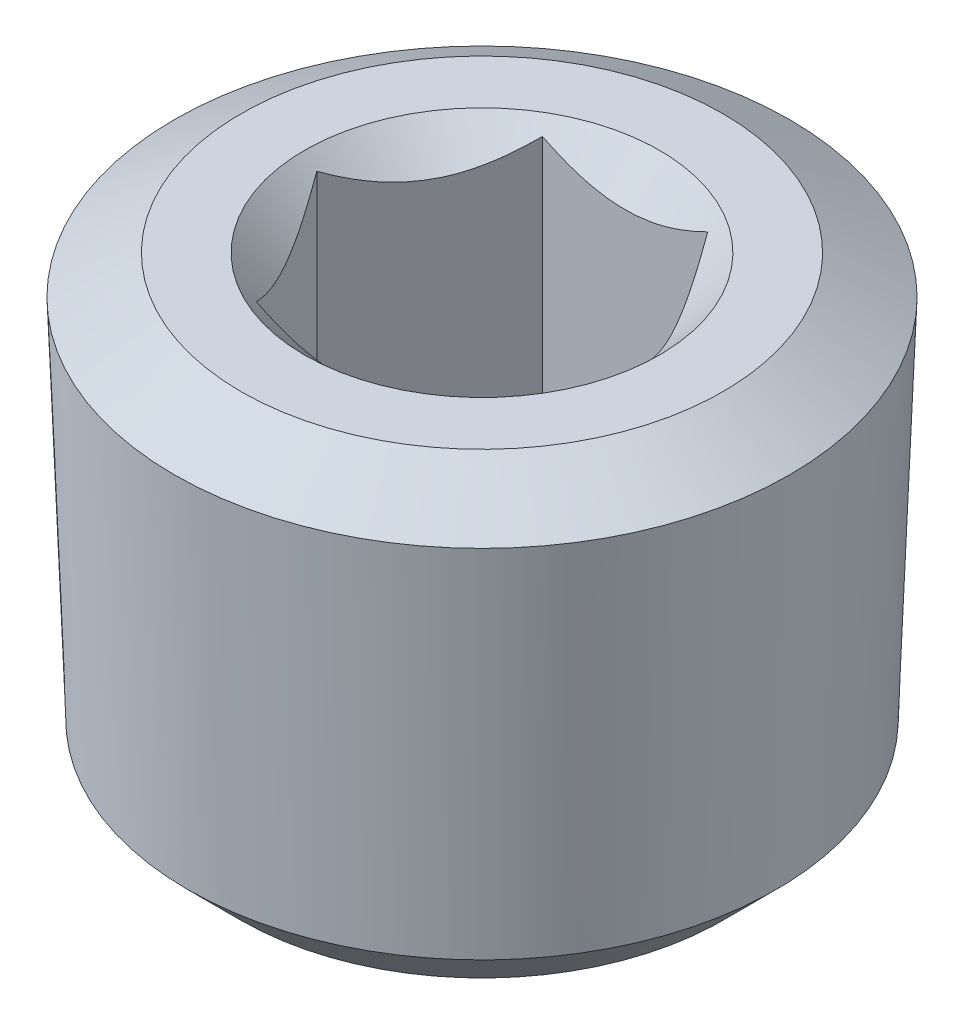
from build123d import *

# Parameters (mm, degrees)
CUT_EXTRUDE1_START = -5.588
CUT_EXTRUDE1_DEPTH = 5.317174


with BuildPart() as part:
    # Sketch2 → Revolve1 (revolve)
    with BuildSketch(Plane.XY, mode=Mode.PRIVATE) as revolve1_sk:
        Polygon((0, 0), (-5.344580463, 0), (-6.826800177, -0.855759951), (-6.530829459, -8.973751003), (-5.344580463, -10.16), (0, -10.16), align=None)
    revolve(revolve1_sk.sketch.rotate(Axis((0, 10.744282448, 0), (0, -1, 0)), 270), axis=Axis((0, 10.744282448, 0), (0, -1, 0)))

    # Sketch3 → Cut-Revolve1 (revolve, cut)
    with BuildSketch(Plane.XY, mode=Mode.PRIVATE) as cut_revolve1_sk:
        Polygon((0, 0), (-3.937, 0), (-3.175, -0.762), (-3.175, -5.588), (0, -7.495732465), align=None)
    revolve(cut_revolve1_sk.sketch.rotate(Axis((0, 2.934222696, 0), (0, -1, 0)), 270), axis=Axis((0, 2.934222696, 0), (0, -1, 0)), mode=Mode.SUBTRACT)

    # Sketch4 → Cut-Extrude1 (cut)
    with BuildSketch(Plane(origin=(0, 0, 0), x_dir=(1, 0, 0), z_dir=(0, 1, 0)).offset(CUT_EXTRUDE1_START)):
        Polygon((-1.833087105, -3.175), (1.833087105, -3.175), (3.666174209, 0), (1.833087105, 3.175), (-1.833087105, 3.175), (-3.666174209, 0), align=None)
    extrude(amount=CUT_EXTRUDE1_DEPTH, mode=Mode.SUBTRACT)


solid = part.part
